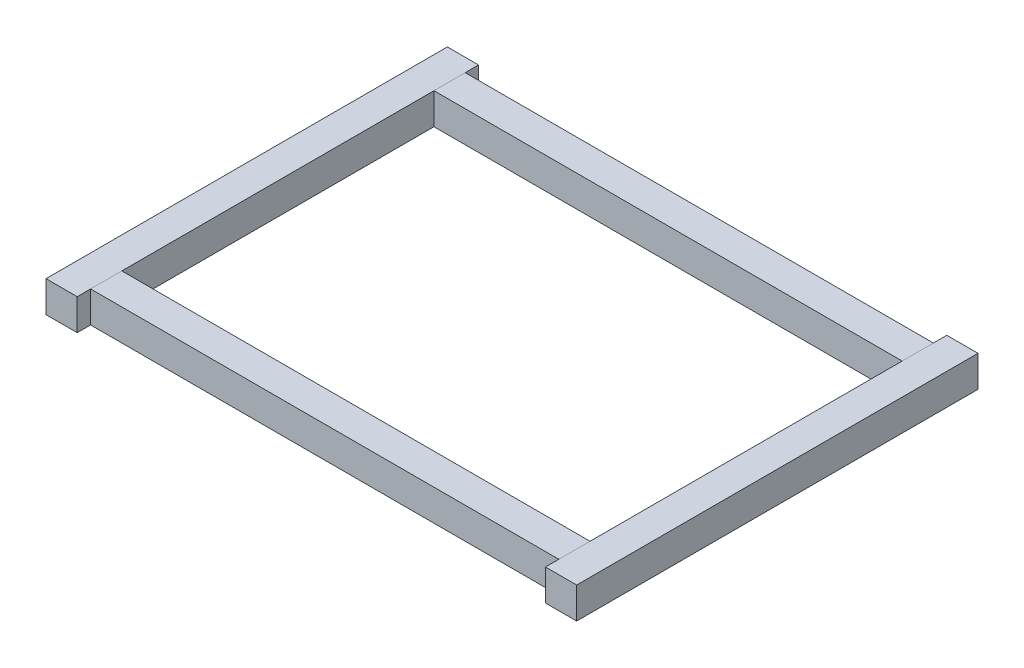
ISO-10303-21;
HEADER;
FILE_DESCRIPTION(('STEP AP214'),'2;1');
FILE_NAME('part.step','',(''),(''),'','','');
FILE_SCHEMA(('AUTOMOTIVE_DESIGN { 1 0 10303 214 1 1 1 1 }'));
ENDSEC;
DATA;
#1=APPLICATION_CONTEXT('core data for automotive mechanical design processes');
#2=APPLICATION_PROTOCOL_DEFINITION('international standard','automotive_design',2000,#1);
#3=PRODUCT_CONTEXT('',#1,'mechanical');
#4=PRODUCT('Part','Part','',(#3));
#5=PRODUCT_RELATED_PRODUCT_CATEGORY('part','',(#4));
#6=PRODUCT_DEFINITION_FORMATION('','',#4);
#7=PRODUCT_DEFINITION_CONTEXT('part definition',#1,'design');
#8=PRODUCT_DEFINITION('design','',#6,#7);
#9=PRODUCT_DEFINITION_SHAPE('','',#8);
#10=(LENGTH_UNIT() NAMED_UNIT(*) SI_UNIT(.MILLI.,.METRE.));
#11=(NAMED_UNIT(*) PLANE_ANGLE_UNIT() SI_UNIT($,.RADIAN.));
#12=(NAMED_UNIT(*) SI_UNIT($,.STERADIAN.) SOLID_ANGLE_UNIT());
#13=UNCERTAINTY_MEASURE_WITH_UNIT(LENGTH_MEASURE(1.E-05),#10,'distance_accuracy_value','');
#14=(GEOMETRIC_REPRESENTATION_CONTEXT(3) GLOBAL_UNCERTAINTY_ASSIGNED_CONTEXT((#13)) GLOBAL_UNIT_ASSIGNED_CONTEXT((#10,
#11,#12)) REPRESENTATION_CONTEXT('',''));
#15=CARTESIAN_POINT('',(0.,0.,0.));
#16=DIRECTION('',(0.,0.,1.));
#17=DIRECTION('',(1.,0.,0.));
#18=AXIS2_PLACEMENT_3D('',#15,#16,#17);
#19=CARTESIAN_POINT('',(210.,0.,180.));
#20=DIRECTION('',(1.,0.,0.));
#21=DIRECTION('',(0.,0.,-1.));
#22=AXIS2_PLACEMENT_3D('',#19,#20,#21);
#23=PLANE('',#22);
#24=DIRECTION('',(0.,-1.,0.));
#25=VECTOR('',#24,1.);
#26=CARTESIAN_POINT('',(209.99999999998,14.,174.));
#27=LINE('',#26,#25);
#28=CARTESIAN_POINT('',(210.000000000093,14.,174.));
#29=VERTEX_POINT('',#28);
#30=CARTESIAN_POINT('',(210.000000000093,0.,174.));
#31=VERTEX_POINT('',#30);
#32=EDGE_CURVE('E95',#29,#31,#27,.T.);
#33=ORIENTED_EDGE('',*,*,#32,.T.);
#34=DIRECTION('',(0.,0.,-1.));
#35=VECTOR('',#34,1.);
#36=CARTESIAN_POINT('',(210.,0.,180.));
#37=LINE('',#36,#35);
#38=CARTESIAN_POINT('',(210.000000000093,0.,160.));
#39=VERTEX_POINT('',#38);
#40=EDGE_CURVE('E93',#31,#39,#37,.T.);
#41=ORIENTED_EDGE('',*,*,#40,.T.);
#42=DIRECTION('',(0.,1.,0.));
#43=VECTOR('',#42,1.);
#44=CARTESIAN_POINT('',(209.99999999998,14.,160.));
#45=LINE('',#44,#43);
#46=CARTESIAN_POINT('',(210.000000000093,14.,160.));
#47=VERTEX_POINT('',#46);
#48=EDGE_CURVE('E48',#39,#47,#45,.T.);
#49=ORIENTED_EDGE('',*,*,#48,.T.);
#50=DIRECTION('',(0.,0.,-1.));
#51=VECTOR('',#50,1.);
#52=CARTESIAN_POINT('',(210.,14.,180.));
#53=LINE('',#52,#51);
#54=EDGE_CURVE('E104',#29,#47,#53,.T.);
#55=ORIENTED_EDGE('',*,*,#54,.F.);
#56=EDGE_LOOP('',(#33,#41,#49,#55));
#57=FACE_BOUND('',#56,.T.);
#58=ADVANCED_FACE('F44',(#57),#23,.T.);
#59=CARTESIAN_POINT('',(500000.,0.,174.));
#60=DIRECTION('',(0.,1.,0.));
#61=DIRECTION('',(0.,0.,1.));
#62=AXIS2_PLACEMENT_3D('',#59,#60,#61);
#63=PLANE('',#62);
#64=ORIENTED_EDGE('',*,*,#40,.F.);
#65=DIRECTION('',(-1.,0.,0.));
#66=VECTOR('',#65,1.);
#67=CARTESIAN_POINT('',(500000.,0.,174.));
#68=LINE('',#67,#66);
#69=CARTESIAN_POINT('',(0.,0.,174.));
#70=VERTEX_POINT('',#69);
#71=EDGE_CURVE('E101',#31,#70,#68,.T.);
#72=ORIENTED_EDGE('',*,*,#71,.T.);
#73=DIRECTION('',(0.,0.,-1.));
#74=VECTOR('',#73,1.);
#75=CARTESIAN_POINT('',(0.,0.,174.));
#76=LINE('',#75,#74);
#77=CARTESIAN_POINT('',(0.,0.,160.));
#78=VERTEX_POINT('',#77);
#79=EDGE_CURVE('E53',#70,#78,#76,.T.);
#80=ORIENTED_EDGE('',*,*,#79,.T.);
#81=DIRECTION('',(-1.,0.,0.));
#82=VECTOR('',#81,1.);
#83=CARTESIAN_POINT('',(500000.,0.,160.));
#84=LINE('',#83,#82);
#85=EDGE_CURVE('E90',#39,#78,#84,.T.);
#86=ORIENTED_EDGE('',*,*,#85,.F.);
#87=EDGE_LOOP('',(#64,#72,#80,#86));
#88=FACE_BOUND('',#87,.T.);
#89=ADVANCED_FACE('F98',(#88),#63,.F.);
#90=CARTESIAN_POINT('',(0.,0.,174.));
#91=DIRECTION('',(1.,0.,0.));
#92=DIRECTION('',(0.,0.,-1.));
#93=AXIS2_PLACEMENT_3D('',#90,#91,#92);
#94=PLANE('',#93);
#95=DIRECTION('',(0.,-1.,0.));
#96=VECTOR('',#95,1.);
#97=CARTESIAN_POINT('',(0.,14.,174.));
#98=LINE('',#97,#96);
#99=CARTESIAN_POINT('',(0.,14.,174.));
#100=VERTEX_POINT('',#99);
#101=EDGE_CURVE('E12',#100,#70,#98,.T.);
#102=ORIENTED_EDGE('',*,*,#101,.F.);
#103=DIRECTION('',(0.,0.,1.));
#104=VECTOR('',#103,1.);
#105=CARTESIAN_POINT('',(0.,14.,174.));
#106=LINE('',#105,#104);
#107=CARTESIAN_POINT('',(0.,14.,160.));
#108=VERTEX_POINT('',#107);
#109=EDGE_CURVE('E109',#108,#100,#106,.T.);
#110=ORIENTED_EDGE('',*,*,#109,.F.);
#111=DIRECTION('',(0.,1.,0.));
#112=VECTOR('',#111,1.);
#113=CARTESIAN_POINT('',(0.,14.,160.));
#114=LINE('',#113,#112);
#115=EDGE_CURVE('E112',#78,#108,#114,.T.);
#116=ORIENTED_EDGE('',*,*,#115,.F.);
#117=ORIENTED_EDGE('',*,*,#79,.F.);
#118=EDGE_LOOP('',(#102,#110,#116,#117));
#119=FACE_BOUND('',#118,.T.);
#120=ADVANCED_FACE('F118',(#119),#94,.F.);
#121=CARTESIAN_POINT('',(500000.,14.,160.));
#122=DIRECTION('',(0.,0.,1.));
#123=DIRECTION('',(1.,0.,0.));
#124=AXIS2_PLACEMENT_3D('',#121,#122,#123);
#125=PLANE('',#124);
#126=ORIENTED_EDGE('',*,*,#48,.F.);
#127=ORIENTED_EDGE('',*,*,#85,.T.);
#128=ORIENTED_EDGE('',*,*,#115,.T.);
#129=DIRECTION('',(-1.,0.,0.));
#130=VECTOR('',#129,1.);
#131=CARTESIAN_POINT('',(500000.,14.,160.));
#132=LINE('',#131,#130);
#133=EDGE_CURVE('E67',#47,#108,#132,.T.);
#134=ORIENTED_EDGE('',*,*,#133,.F.);
#135=EDGE_LOOP('',(#126,#127,#128,#134));
#136=FACE_BOUND('',#135,.T.);
#137=ADVANCED_FACE('F88',(#136),#125,.F.);
#138=CARTESIAN_POINT('',(500000.,14.,174.));
#139=DIRECTION('',(0.,0.,-1.));
#140=DIRECTION('',(-1.,0.,0.));
#141=AXIS2_PLACEMENT_3D('',#138,#139,#140);
#142=PLANE('',#141);
#143=ORIENTED_EDGE('',*,*,#32,.F.);
#144=DIRECTION('',(-1.,0.,0.));
#145=VECTOR('',#144,1.);
#146=CARTESIAN_POINT('',(500000.,14.,174.));
#147=LINE('',#146,#145);
#148=EDGE_CURVE('E60',#29,#100,#147,.T.);
#149=ORIENTED_EDGE('',*,*,#148,.T.);
#150=ORIENTED_EDGE('',*,*,#101,.T.);
#151=ORIENTED_EDGE('',*,*,#71,.F.);
#152=EDGE_LOOP('',(#143,#149,#150,#151));
#153=FACE_BOUND('',#152,.T.);
#154=ADVANCED_FACE('F46',(#153),#142,.F.);
#155=CARTESIAN_POINT('',(500000.,14.,174.));
#156=DIRECTION('',(0.,-1.,0.));
#157=DIRECTION('',(0.,0.,-1.));
#158=AXIS2_PLACEMENT_3D('',#155,#156,#157);
#159=PLANE('',#158);
#160=ORIENTED_EDGE('',*,*,#148,.F.);
#161=ORIENTED_EDGE('',*,*,#54,.T.);
#162=ORIENTED_EDGE('',*,*,#133,.T.);
#163=ORIENTED_EDGE('',*,*,#109,.T.);
#164=EDGE_LOOP('',(#160,#161,#162,#163));
#165=FACE_BOUND('',#164,.T.);
#166=ADVANCED_FACE('F116',(#165),#159,.F.);
#167=CLOSED_SHELL('',(#58,#89,#120,#137,#154,#166));
#168=MANIFOLD_SOLID_BREP('B2',#167);
#169=CARTESIAN_POINT('',(210.,0.,180.));
#170=DIRECTION('',(1.,0.,0.));
#171=DIRECTION('',(0.,0.,-1.));
#172=AXIS2_PLACEMENT_3D('',#169,#170,#171);
#173=PLANE('',#172);
#174=DIRECTION('',(0.,1.,0.));
#175=VECTOR('',#174,1.);
#176=CARTESIAN_POINT('',(209.99999999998,14.,6.00000000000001));
#177=LINE('',#176,#175);
#178=CARTESIAN_POINT('',(210.000000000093,0.,6.));
#179=VERTEX_POINT('',#178);
#180=CARTESIAN_POINT('',(210.000000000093,14.,6.00000000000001));
#181=VERTEX_POINT('',#180);
#182=EDGE_CURVE('E224',#179,#181,#177,.T.);
#183=ORIENTED_EDGE('',*,*,#182,.T.);
#184=DIRECTION('',(0.,0.,-1.));
#185=VECTOR('',#184,1.);
#186=CARTESIAN_POINT('',(210.,14.,180.));
#187=LINE('',#186,#185);
#188=CARTESIAN_POINT('',(210.000000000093,14.,20.));
#189=VERTEX_POINT('',#188);
#190=EDGE_CURVE('E233',#189,#181,#187,.T.);
#191=ORIENTED_EDGE('',*,*,#190,.F.);
#192=DIRECTION('',(0.,-1.,0.));
#193=VECTOR('',#192,1.);
#194=CARTESIAN_POINT('',(209.99999999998,14.,20.));
#195=LINE('',#194,#193);
#196=CARTESIAN_POINT('',(210.000000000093,0.,20.));
#197=VERTEX_POINT('',#196);
#198=EDGE_CURVE('E225',#189,#197,#195,.T.);
#199=ORIENTED_EDGE('',*,*,#198,.T.);
#200=DIRECTION('',(0.,0.,-1.));
#201=VECTOR('',#200,1.);
#202=CARTESIAN_POINT('',(210.,0.,180.));
#203=LINE('',#202,#201);
#204=EDGE_CURVE('E182',#197,#179,#203,.T.);
#205=ORIENTED_EDGE('',*,*,#204,.T.);
#206=EDGE_LOOP('',(#183,#191,#199,#205));
#207=FACE_BOUND('',#206,.T.);
#208=ADVANCED_FACE('F178',(#207),#173,.T.);
#209=CARTESIAN_POINT('',(500000.,14.,6.00000000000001));
#210=DIRECTION('',(0.,-1.,0.));
#211=DIRECTION('',(0.,0.,-1.));
#212=AXIS2_PLACEMENT_3D('',#209,#210,#211);
#213=PLANE('',#212);
#214=DIRECTION('',(-1.,0.,0.));
#215=VECTOR('',#214,1.);
#216=CARTESIAN_POINT('',(500000.,14.,20.));
#217=LINE('',#216,#215);
#218=CARTESIAN_POINT('',(0.,14.,20.));
#219=VERTEX_POINT('',#218);
#220=EDGE_CURVE('E203',#189,#219,#217,.T.);
#221=ORIENTED_EDGE('',*,*,#220,.F.);
#222=ORIENTED_EDGE('',*,*,#190,.T.);
#223=DIRECTION('',(-1.,0.,0.));
#224=VECTOR('',#223,1.);
#225=CARTESIAN_POINT('',(500000.,14.,6.00000000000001));
#226=LINE('',#225,#224);
#227=CARTESIAN_POINT('',(0.,14.,6.00000000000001));
#228=VERTEX_POINT('',#227);
#229=EDGE_CURVE('E195',#181,#228,#226,.T.);
#230=ORIENTED_EDGE('',*,*,#229,.T.);
#231=DIRECTION('',(0.,0.,1.));
#232=VECTOR('',#231,1.);
#233=CARTESIAN_POINT('',(0.,14.,6.00000000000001));
#234=LINE('',#233,#232);
#235=EDGE_CURVE('E237',#228,#219,#234,.T.);
#236=ORIENTED_EDGE('',*,*,#235,.T.);
#237=EDGE_LOOP('',(#221,#222,#230,#236));
#238=FACE_BOUND('',#237,.T.);
#239=ADVANCED_FACE('F248',(#238),#213,.F.);
#240=CARTESIAN_POINT('',(500000.,14.,6.00000000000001));
#241=DIRECTION('',(0.,0.,1.));
#242=DIRECTION('',(0.,-1.,0.));
#243=AXIS2_PLACEMENT_3D('',#240,#241,#242);
#244=PLANE('',#243);
#245=ORIENTED_EDGE('',*,*,#182,.F.);
#246=DIRECTION('',(-1.,0.,0.));
#247=VECTOR('',#246,1.);
#248=CARTESIAN_POINT('',(500000.,0.,6.));
#249=LINE('',#248,#247);
#250=CARTESIAN_POINT('',(0.,0.,6.));
#251=VERTEX_POINT('',#250);
#252=EDGE_CURVE('E231',#179,#251,#249,.T.);
#253=ORIENTED_EDGE('',*,*,#252,.T.);
#254=DIRECTION('',(0.,1.,0.));
#255=VECTOR('',#254,1.);
#256=CARTESIAN_POINT('',(0.,14.,6.00000000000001));
#257=LINE('',#256,#255);
#258=EDGE_CURVE('E42',#251,#228,#257,.T.);
#259=ORIENTED_EDGE('',*,*,#258,.T.);
#260=ORIENTED_EDGE('',*,*,#229,.F.);
#261=EDGE_LOOP('',(#245,#253,#259,#260));
#262=FACE_BOUND('',#261,.T.);
#263=ADVANCED_FACE('F230',(#262),#244,.F.);
#264=CARTESIAN_POINT('',(0.,0.,6.));
#265=DIRECTION('',(-1.,0.,0.));
#266=DIRECTION('',(0.,0.,1.));
#267=AXIS2_PLACEMENT_3D('',#264,#265,#266);
#268=PLANE('',#267);
#269=ORIENTED_EDGE('',*,*,#258,.F.);
#270=DIRECTION('',(0.,0.,-1.));
#271=VECTOR('',#270,1.);
#272=CARTESIAN_POINT('',(0.,0.,6.));
#273=LINE('',#272,#271);
#274=CARTESIAN_POINT('',(0.,0.,20.));
#275=VERTEX_POINT('',#274);
#276=EDGE_CURVE('E187',#275,#251,#273,.T.);
#277=ORIENTED_EDGE('',*,*,#276,.F.);
#278=DIRECTION('',(0.,-1.,0.));
#279=VECTOR('',#278,1.);
#280=CARTESIAN_POINT('',(0.,14.,20.));
#281=LINE('',#280,#279);
#282=EDGE_CURVE('E240',#219,#275,#281,.T.);
#283=ORIENTED_EDGE('',*,*,#282,.F.);
#284=ORIENTED_EDGE('',*,*,#235,.F.);
#285=EDGE_LOOP('',(#269,#277,#283,#284));
#286=FACE_BOUND('',#285,.T.);
#287=ADVANCED_FACE('F251',(#286),#268,.T.);
#288=CARTESIAN_POINT('',(500000.,14.,20.));
#289=DIRECTION('',(0.,0.,-1.));
#290=DIRECTION('',(0.,1.,0.));
#291=AXIS2_PLACEMENT_3D('',#288,#289,#290);
#292=PLANE('',#291);
#293=ORIENTED_EDGE('',*,*,#198,.F.);
#294=ORIENTED_EDGE('',*,*,#220,.T.);
#295=ORIENTED_EDGE('',*,*,#282,.T.);
#296=DIRECTION('',(-1.,0.,0.));
#297=VECTOR('',#296,1.);
#298=CARTESIAN_POINT('',(500000.,0.,20.));
#299=LINE('',#298,#297);
#300=EDGE_CURVE('E238',#197,#275,#299,.T.);
#301=ORIENTED_EDGE('',*,*,#300,.F.);
#302=EDGE_LOOP('',(#293,#294,#295,#301));
#303=FACE_BOUND('',#302,.T.);
#304=ADVANCED_FACE('F252',(#303),#292,.F.);
#305=CARTESIAN_POINT('',(500000.,0.,6.));
#306=DIRECTION('',(0.,1.,0.));
#307=DIRECTION('',(0.,0.,1.));
#308=AXIS2_PLACEMENT_3D('',#305,#306,#307);
#309=PLANE('',#308);
#310=ORIENTED_EDGE('',*,*,#204,.F.);
#311=ORIENTED_EDGE('',*,*,#300,.T.);
#312=ORIENTED_EDGE('',*,*,#276,.T.);
#313=ORIENTED_EDGE('',*,*,#252,.F.);
#314=EDGE_LOOP('',(#310,#311,#312,#313));
#315=FACE_BOUND('',#314,.T.);
#316=ADVANCED_FACE('F180',(#315),#309,.F.);
#317=CLOSED_SHELL('',(#208,#239,#263,#287,#304,#316));
#318=MANIFOLD_SOLID_BREP('B6',#317);
#319=CARTESIAN_POINT('',(224.,0.,180.));
#320=DIRECTION('',(0.,1.,0.));
#321=DIRECTION('',(-1.,0.,0.));
#322=AXIS2_PLACEMENT_3D('',#319,#320,#321);
#323=PLANE('',#322);
#324=DIRECTION('',(1.,0.,0.));
#325=VECTOR('',#324,1.);
#326=CARTESIAN_POINT('',(224.,0.,0.));
#327=LINE('',#326,#325);
#328=CARTESIAN_POINT('',(210.,0.,0.));
#329=VERTEX_POINT('',#328);
#330=CARTESIAN_POINT('',(224.,0.,0.));
#331=VERTEX_POINT('',#330);
#332=EDGE_CURVE('E374',#329,#331,#327,.T.);
#333=ORIENTED_EDGE('',*,*,#332,.T.);
#334=DIRECTION('',(0.,0.,-1.));
#335=VECTOR('',#334,1.);
#336=CARTESIAN_POINT('',(224.,0.,180.));
#337=LINE('',#336,#335);
#338=CARTESIAN_POINT('',(224.,0.,180.));
#339=VERTEX_POINT('',#338);
#340=EDGE_CURVE('E176',#339,#331,#337,.T.);
#341=ORIENTED_EDGE('',*,*,#340,.F.);
#342=DIRECTION('',(1.,0.,0.));
#343=VECTOR('',#342,1.);
#344=CARTESIAN_POINT('',(224.,0.,180.));
#345=LINE('',#344,#343);
#346=CARTESIAN_POINT('',(210.,0.,180.));
#347=VERTEX_POINT('',#346);
#348=EDGE_CURVE('E362',#347,#339,#345,.T.);
#349=ORIENTED_EDGE('',*,*,#348,.F.);
#350=DIRECTION('',(0.,0.,-1.));
#351=VECTOR('',#350,1.);
#352=CARTESIAN_POINT('',(210.,0.,180.));
#353=LINE('',#352,#351);
#354=EDGE_CURVE('E370',#347,#329,#353,.T.);
#355=ORIENTED_EDGE('',*,*,#354,.T.);
#356=EDGE_LOOP('',(#333,#341,#349,#355));
#357=FACE_BOUND('',#356,.T.);
#358=ADVANCED_FACE('F311',(#357),#323,.F.);
#359=CARTESIAN_POINT('',(224.,0.,180.));
#360=DIRECTION('',(-1.,0.,0.));
#361=DIRECTION('',(0.,0.,1.));
#362=AXIS2_PLACEMENT_3D('',#359,#360,#361);
#363=PLANE('',#362);
#364=DIRECTION('',(0.,1.,0.));
#365=VECTOR('',#364,1.);
#366=CARTESIAN_POINT('',(224.,0.,0.));
#367=LINE('',#366,#365);
#368=CARTESIAN_POINT('',(224.,14.,0.));
#369=VERTEX_POINT('',#368);
#370=EDGE_CURVE('E366',#331,#369,#367,.T.);
#371=ORIENTED_EDGE('',*,*,#370,.T.);
#372=DIRECTION('',(0.,0.,-1.));
#373=VECTOR('',#372,1.);
#374=CARTESIAN_POINT('',(224.,14.,180.));
#375=LINE('',#374,#373);
#376=CARTESIAN_POINT('',(224.,14.,180.));
#377=VERTEX_POINT('',#376);
#378=EDGE_CURVE('E319',#377,#369,#375,.T.);
#379=ORIENTED_EDGE('',*,*,#378,.F.);
#380=DIRECTION('',(0.,1.,0.));
#381=VECTOR('',#380,1.);
#382=CARTESIAN_POINT('',(224.,0.,180.));
#383=LINE('',#382,#381);
#384=EDGE_CURVE('E357',#339,#377,#383,.T.);
#385=ORIENTED_EDGE('',*,*,#384,.F.);
#386=ORIENTED_EDGE('',*,*,#340,.T.);
#387=EDGE_LOOP('',(#371,#379,#385,#386));
#388=FACE_BOUND('',#387,.T.);
#389=ADVANCED_FACE('F365',(#388),#363,.F.);
#390=CARTESIAN_POINT('',(224.,14.,180.));
#391=DIRECTION('',(0.,-1.,0.));
#392=DIRECTION('',(1.,0.,0.));
#393=AXIS2_PLACEMENT_3D('',#390,#391,#392);
#394=PLANE('',#393);
#395=DIRECTION('',(-1.,0.,0.));
#396=VECTOR('',#395,1.);
#397=CARTESIAN_POINT('',(224.,14.,0.));
#398=LINE('',#397,#396);
#399=CARTESIAN_POINT('',(210.,14.,0.));
#400=VERTEX_POINT('',#399);
#401=EDGE_CURVE('E344',#369,#400,#398,.T.);
#402=ORIENTED_EDGE('',*,*,#401,.T.);
#403=DIRECTION('',(0.,0.,-1.));
#404=VECTOR('',#403,1.);
#405=CARTESIAN_POINT('',(210.,14.,180.));
#406=LINE('',#405,#404);
#407=CARTESIAN_POINT('',(210.,14.,180.));
#408=VERTEX_POINT('',#407);
#409=EDGE_CURVE('E367',#408,#400,#406,.T.);
#410=ORIENTED_EDGE('',*,*,#409,.F.);
#411=DIRECTION('',(-1.,0.,0.));
#412=VECTOR('',#411,1.);
#413=CARTESIAN_POINT('',(224.,14.,180.));
#414=LINE('',#413,#412);
#415=EDGE_CURVE('E360',#377,#408,#414,.T.);
#416=ORIENTED_EDGE('',*,*,#415,.F.);
#417=ORIENTED_EDGE('',*,*,#378,.T.);
#418=EDGE_LOOP('',(#402,#410,#416,#417));
#419=FACE_BOUND('',#418,.T.);
#420=ADVANCED_FACE('F368',(#419),#394,.F.);
#421=CARTESIAN_POINT('',(210.,0.,180.));
#422=DIRECTION('',(1.,0.,0.));
#423=DIRECTION('',(0.,0.,-1.));
#424=AXIS2_PLACEMENT_3D('',#421,#422,#423);
#425=PLANE('',#424);
#426=DIRECTION('',(0.,-1.,0.));
#427=VECTOR('',#426,1.);
#428=CARTESIAN_POINT('',(210.,0.,0.));
#429=LINE('',#428,#427);
#430=EDGE_CURVE('E350',#400,#329,#429,.T.);
#431=ORIENTED_EDGE('',*,*,#430,.T.);
#432=ORIENTED_EDGE('',*,*,#354,.F.);
#433=DIRECTION('',(0.,-1.,0.));
#434=VECTOR('',#433,1.);
#435=CARTESIAN_POINT('',(210.,0.,180.));
#436=LINE('',#435,#434);
#437=EDGE_CURVE('E327',#408,#347,#436,.T.);
#438=ORIENTED_EDGE('',*,*,#437,.F.);
#439=ORIENTED_EDGE('',*,*,#409,.T.);
#440=EDGE_LOOP('',(#431,#432,#438,#439));
#441=FACE_BOUND('',#440,.T.);
#442=ADVANCED_FACE('F381',(#441),#425,.F.);
#443=CARTESIAN_POINT('',(210.,0.,180.));
#444=DIRECTION('',(0.,0.,-1.));
#445=DIRECTION('',(-1.,0.,0.));
#446=AXIS2_PLACEMENT_3D('',#443,#444,#445);
#447=PLANE('',#446);
#448=ORIENTED_EDGE('',*,*,#348,.T.);
#449=ORIENTED_EDGE('',*,*,#384,.T.);
#450=ORIENTED_EDGE('',*,*,#415,.T.);
#451=ORIENTED_EDGE('',*,*,#437,.T.);
#452=EDGE_LOOP('',(#448,#449,#450,#451));
#453=FACE_BOUND('',#452,.T.);
#454=ADVANCED_FACE('F358',(#453),#447,.F.);
#455=CARTESIAN_POINT('',(210.,0.,0.));
#456=DIRECTION('',(0.,0.,-1.));
#457=DIRECTION('',(-1.,0.,0.));
#458=AXIS2_PLACEMENT_3D('',#455,#456,#457);
#459=PLANE('',#458);
#460=ORIENTED_EDGE('',*,*,#332,.F.);
#461=ORIENTED_EDGE('',*,*,#430,.F.);
#462=ORIENTED_EDGE('',*,*,#401,.F.);
#463=ORIENTED_EDGE('',*,*,#370,.F.);
#464=EDGE_LOOP('',(#460,#461,#462,#463));
#465=FACE_BOUND('',#464,.T.);
#466=ADVANCED_FACE('F384',(#465),#459,.T.);
#467=CLOSED_SHELL('',(#358,#389,#420,#442,#454,#466));
#468=MANIFOLD_SOLID_BREP('B36',#467);
#469=CARTESIAN_POINT('',(0.,0.,180.));
#470=DIRECTION('',(-1.,0.,0.));
#471=DIRECTION('',(0.,0.,1.));
#472=AXIS2_PLACEMENT_3D('',#469,#470,#471);
#473=PLANE('',#472);
#474=DIRECTION('',(0.,1.,0.));
#475=VECTOR('',#474,1.);
#476=CARTESIAN_POINT('',(0.,0.,0.));
#477=LINE('',#476,#475);
#478=CARTESIAN_POINT('',(0.,0.,0.));
#479=VERTEX_POINT('',#478);
#480=CARTESIAN_POINT('',(0.,14.,0.));
#481=VERTEX_POINT('',#480);
#482=EDGE_CURVE('E498',#479,#481,#477,.T.);
#483=ORIENTED_EDGE('',*,*,#482,.T.);
#484=DIRECTION('',(0.,0.,-1.));
#485=VECTOR('',#484,1.);
#486=CARTESIAN_POINT('',(0.,14.,180.));
#487=LINE('',#486,#485);
#488=CARTESIAN_POINT('',(0.,14.,180.));
#489=VERTEX_POINT('',#488);
#490=EDGE_CURVE('E309',#489,#481,#487,.T.);
#491=ORIENTED_EDGE('',*,*,#490,.F.);
#492=DIRECTION('',(0.,1.,0.));
#493=VECTOR('',#492,1.);
#494=CARTESIAN_POINT('',(0.,0.,180.));
#495=LINE('',#494,#493);
#496=CARTESIAN_POINT('',(0.,0.,180.));
#497=VERTEX_POINT('',#496);
#498=EDGE_CURVE('E486',#497,#489,#495,.T.);
#499=ORIENTED_EDGE('',*,*,#498,.F.);
#500=DIRECTION('',(0.,0.,-1.));
#501=VECTOR('',#500,1.);
#502=CARTESIAN_POINT('',(0.,0.,180.));
#503=LINE('',#502,#501);
#504=EDGE_CURVE('E494',#497,#479,#503,.T.);
#505=ORIENTED_EDGE('',*,*,#504,.T.);
#506=EDGE_LOOP('',(#483,#491,#499,#505));
#507=FACE_BOUND('',#506,.T.);
#508=ADVANCED_FACE('F435',(#507),#473,.F.);
#509=CARTESIAN_POINT('',(0.,14.,180.));
#510=DIRECTION('',(0.,-1.,0.));
#511=DIRECTION('',(1.,0.,0.));
#512=AXIS2_PLACEMENT_3D('',#509,#510,#511);
#513=PLANE('',#512);
#514=DIRECTION('',(-1.,0.,0.));
#515=VECTOR('',#514,1.);
#516=CARTESIAN_POINT('',(0.,14.,0.));
#517=LINE('',#516,#515);
#518=CARTESIAN_POINT('',(-14.,14.,0.));
#519=VERTEX_POINT('',#518);
#520=EDGE_CURVE('E490',#481,#519,#517,.T.);
#521=ORIENTED_EDGE('',*,*,#520,.T.);
#522=DIRECTION('',(0.,0.,-1.));
#523=VECTOR('',#522,1.);
#524=CARTESIAN_POINT('',(-14.,14.,180.));
#525=LINE('',#524,#523);
#526=CARTESIAN_POINT('',(-14.,14.,180.));
#527=VERTEX_POINT('',#526);
#528=EDGE_CURVE('E443',#527,#519,#525,.T.);
#529=ORIENTED_EDGE('',*,*,#528,.F.);
#530=DIRECTION('',(-1.,0.,0.));
#531=VECTOR('',#530,1.);
#532=CARTESIAN_POINT('',(0.,14.,180.));
#533=LINE('',#532,#531);
#534=EDGE_CURVE('E481',#489,#527,#533,.T.);
#535=ORIENTED_EDGE('',*,*,#534,.F.);
#536=ORIENTED_EDGE('',*,*,#490,.T.);
#537=EDGE_LOOP('',(#521,#529,#535,#536));
#538=FACE_BOUND('',#537,.T.);
#539=ADVANCED_FACE('F489',(#538),#513,.F.);
#540=CARTESIAN_POINT('',(-14.,0.,180.));
#541=DIRECTION('',(1.,0.,0.));
#542=DIRECTION('',(0.,0.,-1.));
#543=AXIS2_PLACEMENT_3D('',#540,#541,#542);
#544=PLANE('',#543);
#545=DIRECTION('',(0.,-1.,0.));
#546=VECTOR('',#545,1.);
#547=CARTESIAN_POINT('',(-14.,0.,0.));
#548=LINE('',#547,#546);
#549=CARTESIAN_POINT('',(-14.,0.,0.));
#550=VERTEX_POINT('',#549);
#551=EDGE_CURVE('E468',#519,#550,#548,.T.);
#552=ORIENTED_EDGE('',*,*,#551,.T.);
#553=DIRECTION('',(0.,0.,-1.));
#554=VECTOR('',#553,1.);
#555=CARTESIAN_POINT('',(-14.,0.,180.));
#556=LINE('',#555,#554);
#557=CARTESIAN_POINT('',(-14.,0.,180.));
#558=VERTEX_POINT('',#557);
#559=EDGE_CURVE('E491',#558,#550,#556,.T.);
#560=ORIENTED_EDGE('',*,*,#559,.F.);
#561=DIRECTION('',(0.,-1.,0.));
#562=VECTOR('',#561,1.);
#563=CARTESIAN_POINT('',(-14.,0.,180.));
#564=LINE('',#563,#562);
#565=EDGE_CURVE('E484',#527,#558,#564,.T.);
#566=ORIENTED_EDGE('',*,*,#565,.F.);
#567=ORIENTED_EDGE('',*,*,#528,.T.);
#568=EDGE_LOOP('',(#552,#560,#566,#567));
#569=FACE_BOUND('',#568,.T.);
#570=ADVANCED_FACE('F492',(#569),#544,.F.);
#571=CARTESIAN_POINT('',(0.,0.,180.));
#572=DIRECTION('',(0.,1.,0.));
#573=DIRECTION('',(-1.,0.,0.));
#574=AXIS2_PLACEMENT_3D('',#571,#572,#573);
#575=PLANE('',#574);
#576=DIRECTION('',(1.,0.,0.));
#577=VECTOR('',#576,1.);
#578=CARTESIAN_POINT('',(0.,0.,0.));
#579=LINE('',#578,#577);
#580=EDGE_CURVE('E474',#550,#479,#579,.T.);
#581=ORIENTED_EDGE('',*,*,#580,.T.);
#582=ORIENTED_EDGE('',*,*,#504,.F.);
#583=DIRECTION('',(1.,0.,0.));
#584=VECTOR('',#583,1.);
#585=CARTESIAN_POINT('',(0.,0.,180.));
#586=LINE('',#585,#584);
#587=EDGE_CURVE('E451',#558,#497,#586,.T.);
#588=ORIENTED_EDGE('',*,*,#587,.F.);
#589=ORIENTED_EDGE('',*,*,#559,.T.);
#590=EDGE_LOOP('',(#581,#582,#588,#589));
#591=FACE_BOUND('',#590,.T.);
#592=ADVANCED_FACE('F505',(#591),#575,.F.);
#593=CARTESIAN_POINT('',(0.,14.,180.));
#594=DIRECTION('',(0.,0.,1.));
#595=DIRECTION('',(1.,0.,0.));
#596=AXIS2_PLACEMENT_3D('',#593,#594,#595);
#597=PLANE('',#596);
#598=ORIENTED_EDGE('',*,*,#498,.T.);
#599=ORIENTED_EDGE('',*,*,#534,.T.);
#600=ORIENTED_EDGE('',*,*,#565,.T.);
#601=ORIENTED_EDGE('',*,*,#587,.T.);
#602=EDGE_LOOP('',(#598,#599,#600,#601));
#603=FACE_BOUND('',#602,.T.);
#604=ADVANCED_FACE('F482',(#603),#597,.T.);
#605=CARTESIAN_POINT('',(0.,14.,0.));
#606=DIRECTION('',(0.,0.,1.));
#607=DIRECTION('',(1.,0.,0.));
#608=AXIS2_PLACEMENT_3D('',#605,#606,#607);
#609=PLANE('',#608);
#610=ORIENTED_EDGE('',*,*,#482,.F.);
#611=ORIENTED_EDGE('',*,*,#580,.F.);
#612=ORIENTED_EDGE('',*,*,#551,.F.);
#613=ORIENTED_EDGE('',*,*,#520,.F.);
#614=EDGE_LOOP('',(#610,#611,#612,#613));
#615=FACE_BOUND('',#614,.T.);
#616=ADVANCED_FACE('F508',(#615),#609,.F.);
#617=CLOSED_SHELL('',(#508,#539,#570,#592,#604,#616));
#618=MANIFOLD_SOLID_BREP('B170',#617);
#619=ADVANCED_BREP_SHAPE_REPRESENTATION('',(#18,#168,#318,#468,#618),#14);
#620=SHAPE_DEFINITION_REPRESENTATION(#9,#619);
ENDSEC;
END-ISO-10303-21;
